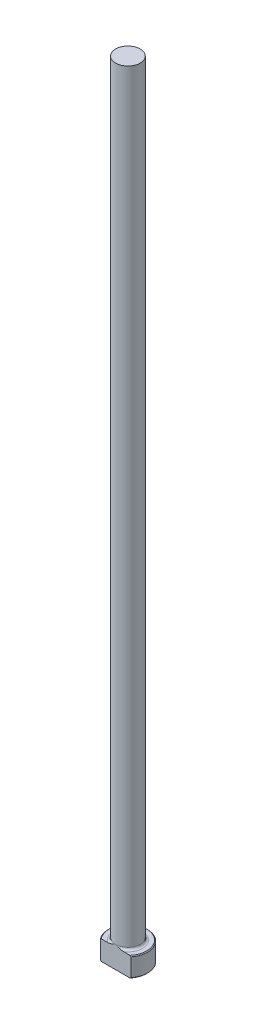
ISO-10303-21;
HEADER;
FILE_DESCRIPTION(('STEP AP214'),'2;1');
FILE_NAME('part.step','',(''),(''),'','','');
FILE_SCHEMA(('AUTOMOTIVE_DESIGN { 1 0 10303 214 1 1 1 1 }'));
ENDSEC;
DATA;
#1=APPLICATION_CONTEXT('core data for automotive mechanical design processes');
#2=APPLICATION_PROTOCOL_DEFINITION('international standard','automotive_design',2000,#1);
#3=PRODUCT_CONTEXT('',#1,'mechanical');
#4=PRODUCT('Part','Part','',(#3));
#5=PRODUCT_RELATED_PRODUCT_CATEGORY('part','',(#4));
#6=PRODUCT_DEFINITION_FORMATION('','',#4);
#7=PRODUCT_DEFINITION_CONTEXT('part definition',#1,'design');
#8=PRODUCT_DEFINITION('design','',#6,#7);
#9=PRODUCT_DEFINITION_SHAPE('','',#8);
#10=(LENGTH_UNIT() NAMED_UNIT(*) SI_UNIT(.MILLI.,.METRE.));
#11=(NAMED_UNIT(*) PLANE_ANGLE_UNIT() SI_UNIT($,.RADIAN.));
#12=(NAMED_UNIT(*) SI_UNIT($,.STERADIAN.) SOLID_ANGLE_UNIT());
#13=UNCERTAINTY_MEASURE_WITH_UNIT(LENGTH_MEASURE(1.E-05),#10,'distance_accuracy_value','');
#14=(GEOMETRIC_REPRESENTATION_CONTEXT(3) GLOBAL_UNCERTAINTY_ASSIGNED_CONTEXT((#13)) GLOBAL_UNIT_ASSIGNED_CONTEXT((#10,
#11,#12)) REPRESENTATION_CONTEXT('',''));
#15=CARTESIAN_POINT('',(0.,0.,0.));
#16=DIRECTION('',(0.,0.,1.));
#17=DIRECTION('',(1.,0.,0.));
#18=AXIS2_PLACEMENT_3D('',#15,#16,#17);
#19=CARTESIAN_POINT('',(0.,0.,0.));
#20=DIRECTION('',(0.,-1.,0.));
#21=DIRECTION('',(0.,0.,-1.));
#22=AXIS2_PLACEMENT_3D('',#19,#20,#21);
#23=PLANE('',#22);
#24=DIRECTION('',(1.,0.,0.));
#25=VECTOR('',#24,1.);
#26=CARTESIAN_POINT('',(-4.95696716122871,0.,3.96874999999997));
#27=LINE('',#26,#25);
#28=CARTESIAN_POINT('',(-4.62711999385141,0.,3.96874999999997));
#29=VERTEX_POINT('',#28);
#30=CARTESIAN_POINT('',(4.62711999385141,0.,3.96874999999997));
#31=VERTEX_POINT('',#30);
#32=EDGE_CURVE('E92',#29,#31,#27,.T.);
#33=ORIENTED_EDGE('',*,*,#32,.F.);
#34=CARTESIAN_POINT('',(0.,0.,0.));
#35=DIRECTION('',(0.,-1.,0.));
#36=DIRECTION('',(0.,0.,-1.));
#37=AXIS2_PLACEMENT_3D('',#34,#35,#36);
#38=CIRCLE('',#37,6.09599999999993);
#39=EDGE_CURVE('E105',#29,#31,#38,.T.);
#40=ORIENTED_EDGE('',*,*,#39,.T.);
#41=EDGE_LOOP('',(#33,#40));
#42=FACE_BOUND('',#41,.T.);
#43=ADVANCED_FACE('F37',(#42),#23,.T.);
#44=CARTESIAN_POINT('',(0.,259.958771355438,0.));
#45=DIRECTION('',(0.,1.,0.));
#46=DIRECTION('',(0.,0.,1.));
#47=AXIS2_PLACEMENT_3D('',#44,#45,#46);
#48=CYLINDRICAL_SURFACE('',#47,6.34999999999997);
#49=DIRECTION('',(0.,-1.,0.));
#50=VECTOR('',#49,1.);
#51=CARTESIAN_POINT('',(-4.95696716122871,254.,3.96874999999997));
#52=LINE('',#51,#50);
#53=CARTESIAN_POINT('',(-4.95696716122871,6.09600000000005,3.96874999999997));
#54=VERTEX_POINT('',#53);
#55=CARTESIAN_POINT('',(-4.95696716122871,0.254000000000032,3.96874999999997));
#56=VERTEX_POINT('',#55);
#57=EDGE_CURVE('E95',#54,#56,#52,.T.);
#58=ORIENTED_EDGE('',*,*,#57,.F.);
#59=CARTESIAN_POINT('',(0.,6.09600000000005,0.));
#60=DIRECTION('',(0.,1.,0.));
#61=DIRECTION('',(0.,0.,1.));
#62=AXIS2_PLACEMENT_3D('',#59,#60,#61);
#63=CIRCLE('',#62,6.34999999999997);
#64=CARTESIAN_POINT('',(4.95696716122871,6.09600000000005,3.96874999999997));
#65=VERTEX_POINT('',#64);
#66=EDGE_CURVE('E109',#54,#65,#63,.F.);
#67=ORIENTED_EDGE('',*,*,#66,.T.);
#68=DIRECTION('',(0.,-1.,0.));
#69=VECTOR('',#68,1.);
#70=CARTESIAN_POINT('',(4.95696716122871,254.,3.96874999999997));
#71=LINE('',#70,#69);
#72=CARTESIAN_POINT('',(4.95696716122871,0.254000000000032,3.96874999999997));
#73=VERTEX_POINT('',#72);
#74=EDGE_CURVE('E187',#65,#73,#71,.T.);
#75=ORIENTED_EDGE('',*,*,#74,.T.);
#76=CARTESIAN_POINT('',(0.,0.254000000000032,0.));
#77=DIRECTION('',(0.,-1.,0.));
#78=DIRECTION('',(0.,0.,-1.));
#79=AXIS2_PLACEMENT_3D('',#76,#77,#78);
#80=CIRCLE('',#79,6.34999999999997);
#81=EDGE_CURVE('E115',#73,#56,#80,.F.);
#82=ORIENTED_EDGE('',*,*,#81,.T.);
#83=EDGE_LOOP('',(#58,#67,#75,#82));
#84=FACE_BOUND('',#83,.T.);
#85=ADVANCED_FACE('F160',(#84),#48,.T.);
#86=CARTESIAN_POINT('',(-6.34999999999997,6.35,0.));
#87=DIRECTION('',(0.,1.,0.));
#88=DIRECTION('',(0.,0.,1.));
#89=AXIS2_PLACEMENT_3D('',#86,#87,#88);
#90=PLANE('',#89);
#91=DIRECTION('',(-1.,0.,0.));
#92=VECTOR('',#91,1.);
#93=CARTESIAN_POINT('',(-6.34999999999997,6.35,3.96874999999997));
#94=LINE('',#93,#92);
#95=CARTESIAN_POINT('',(4.62711999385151,6.35,3.96874999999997));
#96=VERTEX_POINT('',#95);
#97=CARTESIAN_POINT('',(2.57468813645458,6.35,3.96874999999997));
#98=VERTEX_POINT('',#97);
#99=EDGE_CURVE('E58',#96,#98,#94,.T.);
#100=ORIENTED_EDGE('',*,*,#99,.F.);
#101=CARTESIAN_POINT('',(0.,6.35,0.));
#102=DIRECTION('',(0.,1.,0.));
#103=DIRECTION('',(0.,0.,1.));
#104=AXIS2_PLACEMENT_3D('',#101,#102,#103);
#105=CIRCLE('',#104,6.09600000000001);
#106=CARTESIAN_POINT('',(-4.62711999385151,6.35,3.96874999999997));
#107=VERTEX_POINT('',#106);
#108=EDGE_CURVE('E182',#96,#107,#105,.T.);
#109=ORIENTED_EDGE('',*,*,#108,.T.);
#110=CARTESIAN_POINT('',(-2.57468813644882,6.35000000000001,3.96874999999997));
#111=VERTEX_POINT('',#110);
#112=EDGE_CURVE('E140',#111,#107,#94,.T.);
#113=ORIENTED_EDGE('',*,*,#112,.F.);
#114=CARTESIAN_POINT('',(0.,6.35,0.));
#115=DIRECTION('',(0.,1.,0.));
#116=DIRECTION('',(0.,0.,1.));
#117=AXIS2_PLACEMENT_3D('',#114,#115,#116);
#118=CIRCLE('',#117,4.73074999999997);
#119=EDGE_CURVE('E112',#111,#98,#118,.F.);
#120=ORIENTED_EDGE('',*,*,#119,.T.);
#121=EDGE_LOOP('',(#100,#109,#113,#120));
#122=FACE_BOUND('',#121,.T.);
#123=ADVANCED_FACE('F164',(#122),#90,.T.);
#124=CARTESIAN_POINT('',(0.,259.958771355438,0.));
#125=DIRECTION('',(0.,1.,0.));
#126=DIRECTION('',(0.,0.,1.));
#127=AXIS2_PLACEMENT_3D('',#124,#125,#126);
#128=CYLINDRICAL_SURFACE('',#127,3.96874999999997);
#129=CARTESIAN_POINT('',(0.,7.11200000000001,0.));
#130=DIRECTION('',(0.,1.,0.));
#131=DIRECTION('',(0.,0.,1.));
#132=AXIS2_PLACEMENT_3D('',#129,#130,#131);
#133=CIRCLE('',#132,3.96874999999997);
#134=CARTESIAN_POINT('',(0.,7.11200000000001,3.96874999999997));
#135=VERTEX_POINT('',#134);
#136=EDGE_CURVE('E108',#135,#135,#133,.T.);
#137=ORIENTED_EDGE('',*,*,#136,.T.);
#138=EDGE_LOOP('',(#137));
#139=FACE_BOUND('',#138,.T.);
#140=CARTESIAN_POINT('',(0.,254.,0.));
#141=DIRECTION('',(0.,1.,0.));
#142=DIRECTION('',(0.,0.,1.));
#143=AXIS2_PLACEMENT_3D('',#140,#141,#142);
#144=CIRCLE('',#143,3.96874999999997);
#145=CARTESIAN_POINT('',(0.,254.,3.96874999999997));
#146=VERTEX_POINT('',#145);
#147=EDGE_CURVE('E100',#146,#146,#144,.T.);
#148=ORIENTED_EDGE('',*,*,#147,.F.);
#149=EDGE_LOOP('',(#148));
#150=FACE_BOUND('',#149,.T.);
#151=ADVANCED_FACE('F169',(#139,#150),#128,.T.);
#152=CARTESIAN_POINT('',(-3.96874999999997,254.,0.));
#153=DIRECTION('',(0.,1.,0.));
#154=DIRECTION('',(0.,0.,1.));
#155=AXIS2_PLACEMENT_3D('',#152,#153,#154);
#156=PLANE('',#155);
#157=ORIENTED_EDGE('',*,*,#147,.T.);
#158=EDGE_LOOP('',(#157));
#159=FACE_BOUND('',#158,.T.);
#160=ADVANCED_FACE('F127',(#159),#156,.T.);
#161=CARTESIAN_POINT('',(0.,6.35000000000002,0.));
#162=DIRECTION('',(0.,-1.,0.));
#163=DIRECTION('',(0.,0.,-1.));
#164=AXIS2_PLACEMENT_3D('',#161,#162,#163);
#165=CONICAL_SURFACE('',#164,6.09599999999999,0.78539816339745);
#166=CARTESIAN_POINT('',(4.95766716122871,6.09545354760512,3.96874999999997));
#167=CARTESIAN_POINT('',(4.84362600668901,6.18446465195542,3.96874999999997));
#168=CARTESIAN_POINT('',(4.72901418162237,6.27275468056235,3.96874999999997));
#169=CARTESIAN_POINT('',(4.49842455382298,6.44757608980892,3.96874999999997));
#170=CARTESIAN_POINT('',(4.38244649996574,6.5341071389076,3.96874999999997));
#171=CARTESIAN_POINT('',(4.14825741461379,6.70556195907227,3.96874999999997));
#172=CARTESIAN_POINT('',(4.03003727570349,6.79047332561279,3.96874999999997));
#173=CARTESIAN_POINT('',(3.79178298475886,6.9577042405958,3.96874999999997));
#174=CARTESIAN_POINT('',(3.67174893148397,7.04002392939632,3.96874999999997));
#175=CARTESIAN_POINT('',(3.42311396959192,7.2058048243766,3.96874999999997));
#176=CARTESIAN_POINT('',(3.29439734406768,7.28909320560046,3.96874999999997));
#177=CARTESIAN_POINT('',(3.03423258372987,7.4512831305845,3.96874999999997));
#178=CARTESIAN_POINT('',(2.90278471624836,7.53018510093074,3.96874999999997));
#179=CARTESIAN_POINT('',(2.63699939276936,7.68229455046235,3.96874999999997));
#180=CARTESIAN_POINT('',(2.50266895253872,7.75551421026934,3.96874999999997));
#181=CARTESIAN_POINT('',(2.23043438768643,7.89493973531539,3.96874999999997));
#182=CARTESIAN_POINT('',(2.09253143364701,7.9611478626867,3.96874999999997));
#183=CARTESIAN_POINT('',(1.82827645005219,8.07780495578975,3.96874999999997));
#184=CARTESIAN_POINT('',(1.70233977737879,8.12918734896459,3.96874999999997));
#185=CARTESIAN_POINT('',(1.44721315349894,8.22328163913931,3.96874999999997));
#186=CARTESIAN_POINT('',(1.31802288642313,8.2659926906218,3.96874999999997));
#187=CARTESIAN_POINT('',(1.05825390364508,8.34044186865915,3.96874999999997));
#188=CARTESIAN_POINT('',(0.927713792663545,8.3723127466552,3.96874999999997));
#189=CARTESIAN_POINT('',(0.664295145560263,8.42410829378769,3.96874999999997));
#190=CARTESIAN_POINT('',(0.53141752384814,8.44403753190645,3.96874999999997));
#191=CARTESIAN_POINT('',(0.262097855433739,8.4708973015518,3.96874999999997));
#192=CARTESIAN_POINT('',(0.125633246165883,8.477606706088,3.96874999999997));
#193=CARTESIAN_POINT('',(-0.14725268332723,8.47686385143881,3.96874999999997));
#194=CARTESIAN_POINT('',(-0.283674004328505,8.4694118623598,3.96874999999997));
#195=CARTESIAN_POINT('',(-0.555656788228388,8.44083507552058,3.96874999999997));
#196=CARTESIAN_POINT('',(-0.691211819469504,8.41965021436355,3.96874999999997));
#197=CARTESIAN_POINT('',(-0.959794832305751,8.36496246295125,3.96874999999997));
#198=CARTESIAN_POINT('',(-1.09282217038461,8.33145647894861,3.96874999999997));
#199=CARTESIAN_POINT('',(-1.4083928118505,8.23843789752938,3.96874999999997));
#200=CARTESIAN_POINT('',(-1.58944011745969,8.17388386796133,3.96874999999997));
#201=CARTESIAN_POINT('',(-1.94516794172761,8.02919443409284,3.96874999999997));
#202=CARTESIAN_POINT('',(-2.11984380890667,7.94904790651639,3.96874999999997));
#203=CARTESIAN_POINT('',(-2.464343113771,7.77678193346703,3.96874999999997));
#204=CARTESIAN_POINT('',(-2.63413363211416,7.68459751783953,3.96874999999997));
#205=CARTESIAN_POINT('',(-2.96866520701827,7.49168011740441,3.96874999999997));
#206=CARTESIAN_POINT('',(-3.13340772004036,7.39094963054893,3.96874999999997));
#207=CARTESIAN_POINT('',(-3.4408871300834,7.19449593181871,3.96874999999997));
#208=CARTESIAN_POINT('',(-3.58405296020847,7.09943870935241,3.96874999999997));
#209=CARTESIAN_POINT('',(-3.86765398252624,6.90532828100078,3.96874999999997));
#210=CARTESIAN_POINT('',(-4.00808899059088,6.80627480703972,3.96874999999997));
#211=CARTESIAN_POINT('',(-4.2844427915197,6.60661425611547,3.96874999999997));
#212=CARTESIAN_POINT('',(-4.42039789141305,6.50605721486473,3.96874999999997));
#213=CARTESIAN_POINT('',(-4.6903816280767,6.30247434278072,3.96874999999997));
#214=CARTESIAN_POINT('',(-4.82441086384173,6.19944930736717,3.96874999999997));
#215=CARTESIAN_POINT('',(-4.95766716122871,6.09545354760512,3.96874999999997));
#216=B_SPLINE_CURVE_WITH_KNOTS('',3,(#166,#167,#168,#169,#170,#171,#172,#173,#174,#175,#176,
#177,#178,#179,#180,#181,#182,#183,#184,#185,#186,#187,#188,#189,#190,#191,#192,#193,#194,#195,
#196,#197,#198,#199,#200,#201,#202,#203,#204,#205,#206,#207,#208,#209,#210,#211,#212,#213,#214,
#215),.UNSPECIFIED.,.F.,.F.,(4,2,2,2,2,2,2,2,2,2,2,2,2,2,2,2,2,2,2,2,2,2,2,2,4),(0.,
0.43400543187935,0.868091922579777,1.3047245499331,1.74133348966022,2.20120262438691,
2.66102695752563,3.11983669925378,3.57849796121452,3.98628616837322,4.39411411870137,
4.7967509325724,5.19923359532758,5.60839324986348,6.01754510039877,6.4284986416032,
6.83955544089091,7.4151649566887,7.99118661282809,8.57045663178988,9.14955791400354,
9.66502728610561,10.1805312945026,10.6878068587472,11.1949210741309),.UNSPECIFIED.);
#217=EDGE_CURVE('E63',#65,#96,#216,.T.);
#218=ORIENTED_EDGE('',*,*,#217,.F.);
#219=ORIENTED_EDGE('',*,*,#66,.F.);
#220=EDGE_CURVE('E133',#107,#54,#216,.T.);
#221=ORIENTED_EDGE('',*,*,#220,.F.);
#222=ORIENTED_EDGE('',*,*,#108,.F.);
#223=EDGE_LOOP('',(#218,#219,#221,#222));
#224=FACE_BOUND('',#223,.T.);
#225=ADVANCED_FACE('F147',(#224),#165,.T.);
#226=CARTESIAN_POINT('',(0.,0.254000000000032,0.));
#227=DIRECTION('',(0.,1.,0.));
#228=DIRECTION('',(0.,0.,1.));
#229=AXIS2_PLACEMENT_3D('',#226,#227,#228);
#230=CONICAL_SURFACE('',#229,6.34999999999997,0.78539816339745);
#231=CARTESIAN_POINT('',(-4.95766716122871,0.254546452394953,3.96874999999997));
#232=CARTESIAN_POINT('',(-4.84362600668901,0.165535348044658,3.96874999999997));
#233=CARTESIAN_POINT('',(-4.72901418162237,0.077245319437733,3.96874999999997));
#234=CARTESIAN_POINT('',(-4.49842455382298,-0.0975760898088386,3.96874999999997));
#235=CARTESIAN_POINT('',(-4.38244649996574,-0.184107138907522,3.96874999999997));
#236=CARTESIAN_POINT('',(-4.14825741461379,-0.355561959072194,3.96874999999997));
#237=CARTESIAN_POINT('',(-4.03003727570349,-0.440473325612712,3.96874999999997));
#238=CARTESIAN_POINT('',(-3.79178298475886,-0.607704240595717,3.96874999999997));
#239=CARTESIAN_POINT('',(-3.67174893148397,-0.690023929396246,3.96874999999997));
#240=CARTESIAN_POINT('',(-3.42311396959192,-0.855804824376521,3.96874999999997));
#241=CARTESIAN_POINT('',(-3.29439734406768,-0.939093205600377,3.96874999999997));
#242=CARTESIAN_POINT('',(-3.03423258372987,-1.10128313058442,3.96874999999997));
#243=CARTESIAN_POINT('',(-2.90278471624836,-1.18018510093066,3.96874999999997));
#244=CARTESIAN_POINT('',(-2.63699939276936,-1.33229455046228,3.96874999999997));
#245=CARTESIAN_POINT('',(-2.50266895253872,-1.40551421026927,3.96874999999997));
#246=CARTESIAN_POINT('',(-2.23043438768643,-1.54493973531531,3.96874999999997));
#247=CARTESIAN_POINT('',(-2.09253143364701,-1.61114786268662,3.96874999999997));
#248=CARTESIAN_POINT('',(-1.82827645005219,-1.72780495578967,3.96874999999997));
#249=CARTESIAN_POINT('',(-1.70233977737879,-1.77918734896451,3.96874999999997));
#250=CARTESIAN_POINT('',(-1.44721315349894,-1.87328163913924,3.96874999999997));
#251=CARTESIAN_POINT('',(-1.31802288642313,-1.91599269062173,3.96874999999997));
#252=CARTESIAN_POINT('',(-1.05825390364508,-1.99044186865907,3.96874999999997));
#253=CARTESIAN_POINT('',(-0.927713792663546,-2.02231274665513,3.96874999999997));
#254=CARTESIAN_POINT('',(-0.664295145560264,-2.07410829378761,3.96874999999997));
#255=CARTESIAN_POINT('',(-0.531417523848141,-2.09403753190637,3.96874999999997));
#256=CARTESIAN_POINT('',(-0.262097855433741,-2.12089730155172,3.96874999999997));
#257=CARTESIAN_POINT('',(-0.125633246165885,-2.12760670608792,3.96874999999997));
#258=CARTESIAN_POINT('',(0.147252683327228,-2.12686385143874,3.96874999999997));
#259=CARTESIAN_POINT('',(0.283674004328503,-2.11941186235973,3.96874999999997));
#260=CARTESIAN_POINT('',(0.555656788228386,-2.0908350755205,3.96874999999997));
#261=CARTESIAN_POINT('',(0.691211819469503,-2.06965021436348,3.96874999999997));
#262=CARTESIAN_POINT('',(0.959794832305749,-2.01496246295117,3.96874999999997));
#263=CARTESIAN_POINT('',(1.0928221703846,-1.98145647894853,3.96874999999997));
#264=CARTESIAN_POINT('',(1.4083928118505,-1.8884378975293,3.96874999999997));
#265=CARTESIAN_POINT('',(1.58944011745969,-1.82388386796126,3.96874999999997));
#266=CARTESIAN_POINT('',(1.9451679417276,-1.67919443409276,3.96874999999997));
#267=CARTESIAN_POINT('',(2.11984380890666,-1.59904790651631,3.96874999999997));
#268=CARTESIAN_POINT('',(2.46434311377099,-1.42678193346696,3.96874999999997));
#269=CARTESIAN_POINT('',(2.63413363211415,-1.33459751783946,3.96874999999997));
#270=CARTESIAN_POINT('',(2.96866520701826,-1.14168011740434,3.96874999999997));
#271=CARTESIAN_POINT('',(3.13340772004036,-1.04094963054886,3.96874999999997));
#272=CARTESIAN_POINT('',(3.4408871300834,-0.844495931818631,3.96874999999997));
#273=CARTESIAN_POINT('',(3.58405296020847,-0.749438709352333,3.96874999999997));
#274=CARTESIAN_POINT('',(3.86765398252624,-0.555328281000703,3.96874999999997));
#275=CARTESIAN_POINT('',(4.00808899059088,-0.456274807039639,3.96874999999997));
#276=CARTESIAN_POINT('',(4.2844427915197,-0.256614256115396,3.96874999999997));
#277=CARTESIAN_POINT('',(4.42039789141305,-0.156057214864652,3.96874999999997));
#278=CARTESIAN_POINT('',(4.6903816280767,0.0475256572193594,3.96874999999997));
#279=CARTESIAN_POINT('',(4.82441086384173,0.150550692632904,3.96874999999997));
#280=CARTESIAN_POINT('',(4.95766716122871,0.254546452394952,3.96874999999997));
#281=B_SPLINE_CURVE_WITH_KNOTS('',3,(#231,#232,#233,#234,#235,#236,#237,#238,#239,#240,#241,
#242,#243,#244,#245,#246,#247,#248,#249,#250,#251,#252,#253,#254,#255,#256,#257,#258,#259,#260,
#261,#262,#263,#264,#265,#266,#267,#268,#269,#270,#271,#272,#273,#274,#275,#276,#277,#278,#279,
#280),.UNSPECIFIED.,.F.,.F.,(4,2,2,2,2,2,2,2,2,2,2,2,2,2,2,2,2,2,2,2,2,2,2,2,4),(0.,
0.434005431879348,0.868091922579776,1.3047245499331,1.74133348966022,2.20120262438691,
2.66102695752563,3.11983669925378,3.57849796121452,3.98628616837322,4.39411411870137,
4.7967509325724,5.19923359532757,5.60839324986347,6.01754510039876,6.4284986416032,
6.83955544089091,7.4151649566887,7.99118661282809,8.57045663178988,9.14955791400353,
9.66502728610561,10.1805312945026,10.6878068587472,11.1949210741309),.UNSPECIFIED.);
#282=EDGE_CURVE('E89',#56,#29,#281,.T.);
#283=ORIENTED_EDGE('',*,*,#282,.F.);
#284=ORIENTED_EDGE('',*,*,#81,.F.);
#285=EDGE_CURVE('E101',#31,#73,#281,.T.);
#286=ORIENTED_EDGE('',*,*,#285,.F.);
#287=ORIENTED_EDGE('',*,*,#39,.F.);
#288=EDGE_LOOP('',(#283,#284,#286,#287));
#289=FACE_BOUND('',#288,.T.);
#290=ADVANCED_FACE('F107',(#289),#230,.T.);
#291=CARTESIAN_POINT('',(0.,7.11200000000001,0.));
#292=DIRECTION('',(0.,1.,0.));
#293=DIRECTION('',(0.,0.,1.));
#294=AXIS2_PLACEMENT_3D('',#291,#292,#293);
#295=TOROIDAL_SURFACE('',#294,4.73074999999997,0.762);
#296=ORIENTED_EDGE('',*,*,#119,.F.);
#297=CARTESIAN_POINT('',(0.,7.11200000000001,3.96874999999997));
#298=CARTESIAN_POINT('',(-2.72452874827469E-10,7.11200100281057,3.96874999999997));
#299=CARTESIAN_POINT('',(-1.89097572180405E-07,7.11200200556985,3.96874999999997));
#300=CARTESIAN_POINT('',(-7.99901127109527E-07,7.11200394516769,3.96874999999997));
#301=CARTESIAN_POINT('',(-1.2266662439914E-06,7.11200488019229,3.96874999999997));
#302=CARTESIAN_POINT('',(-2.25601477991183E-06,7.11200673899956,3.96874999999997));
#303=CARTESIAN_POINT('',(-2.86938873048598E-06,7.11200765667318,3.96874999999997));
#304=CARTESIAN_POINT('',(-4.2009410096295E-06,7.11200939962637,3.96874999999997));
#305=CARTESIAN_POINT('',(-4.91843246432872E-06,7.11201022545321,3.96874999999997));
#306=CARTESIAN_POINT('',(-7.4625804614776E-06,7.11201295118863,3.96874999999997));
#307=CARTESIAN_POINT('',(-9.42693843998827E-06,7.11201472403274,3.96874999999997));
#308=CARTESIAN_POINT('',(-1.35156238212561E-05,7.11201792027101,3.96874999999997));
#309=CARTESIAN_POINT('',(-1.56334419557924E-05,7.11201935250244,3.96874999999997));
#310=CARTESIAN_POINT('',(-2.37794366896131E-05,7.11202462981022,3.96874999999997));
#311=CARTESIAN_POINT('',(-3.00000425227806E-05,7.11202818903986,3.96874999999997));
#312=CARTESIAN_POINT('',(-4.23604379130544E-05,7.11203410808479,3.96874999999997));
#313=CARTESIAN_POINT('',(-4.84662901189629E-05,7.11203654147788,3.96874999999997));
#314=CARTESIAN_POINT('',(-7.41361994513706E-05,7.11204669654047,3.96874999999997));
#315=CARTESIAN_POINT('',(-9.37464432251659E-05,7.11205427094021,3.96874999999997));
#316=CARTESIAN_POINT('',(-0.000130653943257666,7.11206661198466,3.96874999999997));
#317=CARTESIAN_POINT('',(-0.00014786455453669,7.11207162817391,3.96874999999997));
#318=CARTESIAN_POINT('',(-0.000271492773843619,7.11211085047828,3.96874999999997));
#319=CARTESIAN_POINT('',(-0.000372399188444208,7.11216017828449,3.96874999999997));
#320=CARTESIAN_POINT('',(-0.000762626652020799,7.11234384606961,3.96874999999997));
#321=CARTESIAN_POINT('',(-0.00105578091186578,7.1124669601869,3.96874999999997));
#322=CARTESIAN_POINT('',(-0.00218658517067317,7.11294905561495,3.96874999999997));
#323=CARTESIAN_POINT('',(-0.00302029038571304,7.11331980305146,3.96874999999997));
#324=CARTESIAN_POINT('',(-0.00641326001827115,7.11482126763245,3.96874999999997));
#325=CARTESIAN_POINT('',(-0.00897690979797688,7.1159386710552,3.96874999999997));
#326=CARTESIAN_POINT('',(-0.0431521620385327,7.13084393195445,3.96874999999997));
#327=CARTESIAN_POINT('',(-0.0747329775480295,7.14472589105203,3.96874999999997));
#328=CARTESIAN_POINT('',(-0.138371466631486,7.17259981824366,3.96874999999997));
#329=CARTESIAN_POINT('',(-0.170429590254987,7.18659058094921,3.96874999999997));
#330=CARTESIAN_POINT('',(-0.263897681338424,7.22728018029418,3.96874999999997));
#331=CARTESIAN_POINT('',(-0.32534291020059,7.25390148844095,3.96874999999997));
#332=CARTESIAN_POINT('',(-0.45545149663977,7.30966012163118,3.96874999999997));
#333=CARTESIAN_POINT('',(-0.524140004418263,7.33873873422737,3.96874999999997));
#334=CARTESIAN_POINT('',(-0.662588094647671,7.39626071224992,3.96874999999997));
#335=CARTESIAN_POINT('',(-0.732351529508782,7.42469485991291,3.96874999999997));
#336=CARTESIAN_POINT('',(-0.854677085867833,7.47322946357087,3.96874999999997));
#337=CARTESIAN_POINT('',(-0.907124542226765,7.49361793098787,3.96874999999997));
#338=CARTESIAN_POINT('',(-1.01222990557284,7.53345950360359,3.96874999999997));
#339=CARTESIAN_POINT('',(-1.06488701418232,7.55291472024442,3.96874999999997));
#340=CARTESIAN_POINT('',(-1.22118224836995,7.60890100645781,3.96874999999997));
#341=CARTESIAN_POINT('',(-1.32536392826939,7.64394780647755,3.96874999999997));
#342=CARTESIAN_POINT('',(-1.51475689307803,7.70222633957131,3.96874999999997));
#343=CARTESIAN_POINT('',(-1.59966831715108,7.72642606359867,3.96874999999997));
#344=CARTESIAN_POINT('',(-1.77115576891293,7.77055798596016,3.96874999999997));
#345=CARTESIAN_POINT('',(-1.85773874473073,7.79046358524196,3.96874999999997));
#346=CARTESIAN_POINT('',(-2.03663433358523,7.8256694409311,3.96874999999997));
#347=CARTESIAN_POINT('',(-2.12900742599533,7.84066973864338,3.96874999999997));
#348=CARTESIAN_POINT('',(-2.31450882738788,7.86300878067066,3.96874999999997));
#349=CARTESIAN_POINT('',(-2.40763490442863,7.87036510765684,3.96874999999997));
#350=CARTESIAN_POINT('',(-2.58622461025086,7.87533872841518,3.96874999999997));
#351=CARTESIAN_POINT('',(-2.67166229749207,7.87373524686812,3.96874999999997));
#352=CARTESIAN_POINT('',(-2.84116133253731,7.86073590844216,3.96874999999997));
#353=CARTESIAN_POINT('',(-2.92522821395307,7.84942227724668,3.96874999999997));
#354=CARTESIAN_POINT('',(-3.09260159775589,7.81445437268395,3.96874999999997));
#355=CARTESIAN_POINT('',(-3.17586039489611,7.79056108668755,3.96874999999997));
#356=CARTESIAN_POINT('',(-3.33637449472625,7.72711703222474,3.96874999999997));
#357=CARTESIAN_POINT('',(-3.41365062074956,7.6876237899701,3.96874999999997));
#358=CARTESIAN_POINT('',(-3.51798857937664,7.61566535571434,3.96874999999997));
#359=CARTESIAN_POINT('',(-3.55006318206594,7.59045187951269,3.96874999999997));
#360=CARTESIAN_POINT('',(-3.6102188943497,7.53557765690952,3.96874999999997));
#361=CARTESIAN_POINT('',(-3.63830099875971,7.50591802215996,3.96874999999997));
#362=CARTESIAN_POINT('',(-3.68933162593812,7.44181271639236,3.96874999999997));
#363=CARTESIAN_POINT('',(-3.7122145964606,7.40731395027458,3.96874999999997));
#364=CARTESIAN_POINT('',(-3.75063172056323,7.3344255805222,3.96874999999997));
#365=CARTESIAN_POINT('',(-3.76617854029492,7.29604282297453,3.96874999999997));
#366=CARTESIAN_POINT('',(-3.7867432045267,7.22260269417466,3.96874999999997));
#367=CARTESIAN_POINT('',(-3.79297266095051,7.18788564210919,3.96874999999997));
#368=CARTESIAN_POINT('',(-3.79840708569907,7.11791009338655,3.96874999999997));
#369=CARTESIAN_POINT('',(-3.79761729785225,7.08265202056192,3.96874999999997));
#370=CARTESIAN_POINT('',(-3.7897274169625,7.01808169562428,3.96874999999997));
#371=CARTESIAN_POINT('',(-3.78356056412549,6.98864967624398,3.96874999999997));
#372=CARTESIAN_POINT('',(-3.76657344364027,6.93117296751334,3.96874999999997));
#373=CARTESIAN_POINT('',(-3.75575305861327,6.90312831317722,3.96874999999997));
#374=CARTESIAN_POINT('',(-3.72949416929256,6.84779976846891,3.96874999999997));
#375=CARTESIAN_POINT('',(-3.713874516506,6.82060268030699,3.96874999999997));
#376=CARTESIAN_POINT('',(-3.67898159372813,6.76868386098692,3.96874999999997));
#377=CARTESIAN_POINT('',(-3.6597066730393,6.74396325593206,3.96874999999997));
#378=CARTESIAN_POINT('',(-3.60698815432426,6.68446341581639,3.96874999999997));
#379=CARTESIAN_POINT('',(-3.57151931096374,6.65147423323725,3.96874999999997));
#380=CARTESIAN_POINT('',(-3.49575447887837,6.59155388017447,3.96874999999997));
#381=CARTESIAN_POINT('',(-3.45544429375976,6.56464122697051,3.96874999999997));
#382=CARTESIAN_POINT('',(-3.35110964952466,6.50463027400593,3.96874999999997));
#383=CARTESIAN_POINT('',(-3.2851315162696,6.47494717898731,3.96874999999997));
#384=CARTESIAN_POINT('',(-3.1496628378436,6.42615277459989,3.96874999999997));
#385=CARTESIAN_POINT('',(-3.08017671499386,6.40702850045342,3.96874999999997));
#386=CARTESIAN_POINT('',(-2.95179922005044,6.38006601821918,3.96874999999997));
#387=CARTESIAN_POINT('',(-2.89318763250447,6.37083647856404,3.96874999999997));
#388=CARTESIAN_POINT('',(-2.77536712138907,6.35745547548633,3.96874999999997));
#389=CARTESIAN_POINT('',(-2.71615776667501,6.35330798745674,3.96874999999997));
#390=CARTESIAN_POINT('',(-2.53632384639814,6.34734840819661,3.96874999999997));
#391=CARTESIAN_POINT('',(-2.41545754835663,6.35237783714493,3.96874999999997));
#392=CARTESIAN_POINT('',(-2.21811250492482,6.3716785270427,3.96874999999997));
#393=CARTESIAN_POINT('',(-2.14116511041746,6.38201761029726,3.96874999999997));
#394=CARTESIAN_POINT('',(-1.98802972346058,6.40734893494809,3.96874999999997));
#395=CARTESIAN_POINT('',(-1.9118417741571,6.42234143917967,3.96874999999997));
#396=CARTESIAN_POINT('',(-1.6839709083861,6.47322550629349,3.96874999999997));
#397=CARTESIAN_POINT('',(-1.53360062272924,6.5149500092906,3.96874999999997));
#398=CARTESIAN_POINT('',(-1.24863432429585,6.60495823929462,3.96874999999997));
#399=CARTESIAN_POINT('',(-1.11376371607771,6.65241192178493,3.96874999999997));
#400=CARTESIAN_POINT('',(-0.847576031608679,6.75264930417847,3.96874999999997));
#401=CARTESIAN_POINT('',(-0.716236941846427,6.80537521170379,3.96874999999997));
#402=CARTESIAN_POINT('',(-0.544659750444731,6.87676192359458,3.96874999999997));
#403=CARTESIAN_POINT('',(-0.503794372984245,6.89395286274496,3.96874999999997));
#404=CARTESIAN_POINT('',(-0.421123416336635,6.92903262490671,3.96874999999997));
#405=CARTESIAN_POINT('',(-0.37932061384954,6.94692803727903,3.96874999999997));
#406=CARTESIAN_POINT('',(-0.308934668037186,6.97725002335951,3.96874999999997));
#407=CARTESIAN_POINT('',(-0.280329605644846,6.98962609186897,3.96874999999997));
#408=CARTESIAN_POINT('',(-0.223423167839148,7.0143301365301,3.96874999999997));
#409=CARTESIAN_POINT('',(-0.195121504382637,7.02665744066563,3.96874999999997));
#410=CARTESIAN_POINT('',(-0.141398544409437,7.05009288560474,3.96874999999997));
#411=CARTESIAN_POINT('',(-0.115975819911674,7.06119805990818,3.96874999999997));
#412=CARTESIAN_POINT('',(-0.0642235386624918,7.08387460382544,3.96874999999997));
#413=CARTESIAN_POINT('',(-0.0378947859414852,7.09544818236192,3.96874999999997));
#414=CARTESIAN_POINT('',(-0.00898087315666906,7.1080596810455,3.96874999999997));
#415=CARTESIAN_POINT('',(-0.00642114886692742,7.1091753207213,3.96874999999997));
#416=CARTESIAN_POINT('',(-0.00302915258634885,7.11067631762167,3.96874999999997));
#417=CARTESIAN_POINT('',(-0.00219250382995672,7.11104837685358,3.96874999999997));
#418=CARTESIAN_POINT('',(-0.0010579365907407,7.11153207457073,3.96874999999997));
#419=CARTESIAN_POINT('',(-0.000763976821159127,7.11165552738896,3.96874999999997));
#420=CARTESIAN_POINT('',(-0.000372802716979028,7.11183964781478,3.96874999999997));
#421=CARTESIAN_POINT('',(-0.000271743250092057,7.111889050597,3.96874999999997));
#422=CARTESIAN_POINT('',(-0.000147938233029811,7.11192831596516,3.96874999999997));
#423=CARTESIAN_POINT('',(-0.000130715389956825,7.11193333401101,3.96874999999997));
#424=CARTESIAN_POINT('',(-9.3781335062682E-05,7.11194568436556,3.96874999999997));
#425=CARTESIAN_POINT('',(-7.41570977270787E-05,7.11195326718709,3.96874999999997));
#426=CARTESIAN_POINT('',(-4.84714569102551E-05,7.11196343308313,3.96874999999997));
#427=CARTESIAN_POINT('',(-4.23636191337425E-05,7.11196586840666,3.96874999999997));
#428=CARTESIAN_POINT('',(-2.99995408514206E-05,7.11197179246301,3.96874999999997));
#429=CARTESIAN_POINT('',(-2.37773032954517E-05,7.11197535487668,3.96874999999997));
#430=CARTESIAN_POINT('',(-1.5629804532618E-05,7.11198063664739,3.96874999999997));
#431=CARTESIAN_POINT('',(-1.3511828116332E-05,7.11198206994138,3.96874999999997));
#432=CARTESIAN_POINT('',(-9.42304071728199E-06,7.11198526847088,3.96874999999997));
#433=CARTESIAN_POINT('',(-7.45874783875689E-06,7.11198704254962,3.96874999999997));
#434=CARTESIAN_POINT('',(-4.91494695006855E-06,7.11198977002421,3.96874999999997));
#435=CARTESIAN_POINT('',(-4.19760643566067E-06,7.11199059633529,3.96874999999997));
#436=CARTESIAN_POINT('',(-2.86644232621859E-06,7.11199234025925,3.96874999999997));
#437=CARTESIAN_POINT('',(-2.25330635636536E-06,7.11199325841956,3.96874999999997));
#438=CARTESIAN_POINT('',(-1.22453499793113E-06,7.11199511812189,3.96874999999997));
#439=CARTESIAN_POINT('',(-7.98099013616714E-07,7.11199605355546,3.96874999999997));
#440=CARTESIAN_POINT('',(-1.88090826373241E-07,7.11199799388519,3.96874999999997));
#441=CARTESIAN_POINT('',(2.72512968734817E-10,7.11199899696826,3.96874999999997));
#442=CARTESIAN_POINT('',(0.,7.11200000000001,3.96874999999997));
#443=B_SPLINE_CURVE_WITH_KNOTS('',3,(#297,#298,#299,#300,#301,#302,#303,#304,#305,#306,#307,
#308,#309,#310,#311,#312,#313,#314,#315,#316,#317,#318,#319,#320,#321,#322,#323,#324,#325,#326,
#327,#328,#329,#330,#331,#332,#333,#334,#335,#336,#337,#338,#339,#340,#341,#342,#343,#344,#345,
#346,#347,#348,#349,#350,#351,#352,#353,#354,#355,#356,#357,#358,#359,#360,#361,#362,#363,#364,
#365,#366,#367,#368,#369,#370,#371,#372,#373,#374,#375,#376,#377,#378,#379,#380,#381,#382,#383,
#384,#385,#386,#387,#388,#389,#390,#391,#392,#393,#394,#395,#396,#397,#398,#399,#400,#401,#402,
#403,#404,#405,#406,#407,#408,#409,#410,#411,#412,#413,#414,#415,#416,#417,#418,#419,#420,#421,
#422,#423,#424,#425,#426,#427,#428,#429,#430,#431,#432,#433,#434,#435,#436,#437,#438,#439,#440,
#441,#442),.UNSPECIFIED.,.T.,.F.,(4,2,2,2,2,2,2,2,2,2,2,2,2,2,2,2,2,2,2,2,2,2,2,2,2,2,2,2,2,2,2,
2,2,2,2,2,2,2,2,2,2,2,2,2,2,2,2,2,2,2,2,2,2,2,2,2,2,2,2,2,2,2,2,2,2,2,2,2,2,2,2,2,4),(0.,
3.0057780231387E-06,6.07432687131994E-06,9.37314624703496E-06,1.26511167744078E-05,
2.05502244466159E-05,2.82140028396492E-05,4.9640489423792E-05,6.93390753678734E-05,
0.000132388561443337,0.000186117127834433,0.0005216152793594,0.00147666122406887,
0.00421247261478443,0.0126037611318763,0.116083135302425,0.2210203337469,0.42190992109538,
0.645676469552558,0.871672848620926,1.04047829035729,1.20888182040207,1.53851282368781,
1.80329858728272,2.06968019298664,2.3501784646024,2.63003009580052,2.88594405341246,
3.13971207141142,3.39848556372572,3.65631358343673,3.77836256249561,3.90038107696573,
4.02386182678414,4.14712859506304,4.25227920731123,4.35735127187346,4.44716152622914,
4.53697404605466,4.63071137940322,4.72449114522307,4.86898620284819,5.01391581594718,
5.22974914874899,5.44531687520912,5.62306851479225,5.8009591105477,6.16266479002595,
6.3954713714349,6.62829110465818,7.09579230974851,7.52455372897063,7.94904482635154,
8.08204777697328,8.21846301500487,8.31196587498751,8.40457450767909,8.4878041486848,
8.57407464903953,8.58245304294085,8.58519851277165,8.58615618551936,8.58649219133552,
8.5865459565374,8.58660905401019,8.5866287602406,8.58665019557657,8.58665786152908,
8.58666576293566,8.58666904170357,8.58667234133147,8.58667541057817,8.58667841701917),.UNSPECIFIED.);
#444=EDGE_CURVE('E11',#111,#135,#443,.T.);
#445=ORIENTED_EDGE('',*,*,#444,.T.);
#446=ORIENTED_EDGE('',*,*,#136,.F.);
#447=CARTESIAN_POINT('',(0.,7.11200000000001,3.96874999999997));
#448=CARTESIAN_POINT('',(2.72452813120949E-10,7.11199899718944,3.96874999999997));
#449=CARTESIAN_POINT('',(1.89097572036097E-07,7.11199799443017,3.96874999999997));
#450=CARTESIAN_POINT('',(7.99901127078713E-07,7.11199605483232,3.96874999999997));
#451=CARTESIAN_POINT('',(1.22666624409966E-06,7.11199511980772,3.96874999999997));
#452=CARTESIAN_POINT('',(2.25601477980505E-06,7.11199326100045,3.96874999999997));
#453=CARTESIAN_POINT('',(2.86938873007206E-06,7.11199234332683,3.96874999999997));
#454=CARTESIAN_POINT('',(4.20094100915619E-06,7.11199060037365,3.96874999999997));
#455=CARTESIAN_POINT('',(4.91843246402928E-06,7.1119897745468,3.96874999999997));
#456=CARTESIAN_POINT('',(7.46258046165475E-06,7.11198704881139,3.96874999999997));
#457=CARTESIAN_POINT('',(9.42693844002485E-06,7.11198527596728,3.96874999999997));
#458=CARTESIAN_POINT('',(1.35156238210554E-05,7.11198207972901,3.96874999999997));
#459=CARTESIAN_POINT('',(1.56334419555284E-05,7.11198064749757,3.96874999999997));
#460=CARTESIAN_POINT('',(2.3779436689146E-05,7.11197537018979,3.96874999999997));
#461=CARTESIAN_POINT('',(3.00000425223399E-05,7.11197181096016,3.96874999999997));
#462=CARTESIAN_POINT('',(4.23604379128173E-05,7.11196589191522,3.96874999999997));
#463=CARTESIAN_POINT('',(4.84662901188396E-05,7.11196345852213,3.96874999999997));
#464=CARTESIAN_POINT('',(7.41361994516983E-05,7.11195330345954,3.96874999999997));
#465=CARTESIAN_POINT('',(9.37464432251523E-05,7.11194572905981,3.96874999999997));
#466=CARTESIAN_POINT('',(0.000130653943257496,7.11193338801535,3.96874999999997));
#467=CARTESIAN_POINT('',(0.000147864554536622,7.1119283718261,3.96874999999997));
#468=CARTESIAN_POINT('',(0.00027149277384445,7.11188914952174,3.96874999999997));
#469=CARTESIAN_POINT('',(0.000372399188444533,7.11183982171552,3.96874999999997));
#470=CARTESIAN_POINT('',(0.000762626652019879,7.1116561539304,3.96874999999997));
#471=CARTESIAN_POINT('',(0.00105578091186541,7.11153303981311,3.96874999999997));
#472=CARTESIAN_POINT('',(0.00218658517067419,7.11105094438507,3.96874999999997));
#473=CARTESIAN_POINT('',(0.00302029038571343,7.11068019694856,3.96874999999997));
#474=CARTESIAN_POINT('',(0.00641326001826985,7.10917873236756,3.96874999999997));
#475=CARTESIAN_POINT('',(0.00897690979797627,7.10806132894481,3.96874999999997));
#476=CARTESIAN_POINT('',(0.0431521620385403,7.09315606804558,3.96874999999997));
#477=CARTESIAN_POINT('',(0.074732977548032,7.07927410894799,3.96874999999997));
#478=CARTESIAN_POINT('',(0.138371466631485,7.05140018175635,3.96874999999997));
#479=CARTESIAN_POINT('',(0.170429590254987,7.0374094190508,3.96874999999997));
#480=CARTESIAN_POINT('',(0.263897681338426,6.99671981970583,3.96874999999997));
#481=CARTESIAN_POINT('',(0.325342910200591,6.97009851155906,3.96874999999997));
#482=CARTESIAN_POINT('',(0.455451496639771,6.91433987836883,3.96874999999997));
#483=CARTESIAN_POINT('',(0.524140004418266,6.88526126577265,3.96874999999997));
#484=CARTESIAN_POINT('',(0.662588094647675,6.82773928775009,3.96874999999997));
#485=CARTESIAN_POINT('',(0.732351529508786,6.7993051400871,3.96874999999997));
#486=CARTESIAN_POINT('',(0.854677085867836,6.75077053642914,3.96874999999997));
#487=CARTESIAN_POINT('',(0.907124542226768,6.73038206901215,3.96874999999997));
#488=CARTESIAN_POINT('',(1.01222990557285,6.69054049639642,3.96874999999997));
#489=CARTESIAN_POINT('',(1.06488701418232,6.6710852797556,3.96874999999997));
#490=CARTESIAN_POINT('',(1.22118224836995,6.61509899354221,3.96874999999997));
#491=CARTESIAN_POINT('',(1.32536392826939,6.58005219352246,3.96874999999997));
#492=CARTESIAN_POINT('',(1.51475689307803,6.52177366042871,3.96874999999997));
#493=CARTESIAN_POINT('',(1.59966831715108,6.49757393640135,3.96874999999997));
#494=CARTESIAN_POINT('',(1.77115576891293,6.45344201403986,3.96874999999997));
#495=CARTESIAN_POINT('',(1.85773874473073,6.43353641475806,3.96874999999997));
#496=CARTESIAN_POINT('',(2.03663433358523,6.39833055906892,3.96874999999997));
#497=CARTESIAN_POINT('',(2.12900742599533,6.38333026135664,3.96874999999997));
#498=CARTESIAN_POINT('',(2.31450882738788,6.36099121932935,3.96874999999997));
#499=CARTESIAN_POINT('',(2.40763490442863,6.35363489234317,3.96874999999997));
#500=CARTESIAN_POINT('',(2.58622461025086,6.34866127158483,3.96874999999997));
#501=CARTESIAN_POINT('',(2.67166229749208,6.3502647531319,3.96874999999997));
#502=CARTESIAN_POINT('',(2.84116133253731,6.36326409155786,3.96874999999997));
#503=CARTESIAN_POINT('',(2.92522821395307,6.37457772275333,3.96874999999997));
#504=CARTESIAN_POINT('',(3.09260159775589,6.40954562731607,3.96874999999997));
#505=CARTESIAN_POINT('',(3.17586039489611,6.43343891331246,3.96874999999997));
#506=CARTESIAN_POINT('',(3.33637449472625,6.49688296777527,3.96874999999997));
#507=CARTESIAN_POINT('',(3.41365062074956,6.53637621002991,3.96874999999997));
#508=CARTESIAN_POINT('',(3.51798857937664,6.60833464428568,3.96874999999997));
#509=CARTESIAN_POINT('',(3.55006318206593,6.63354812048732,3.96874999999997));
#510=CARTESIAN_POINT('',(3.6102188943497,6.68842234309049,3.96874999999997));
#511=CARTESIAN_POINT('',(3.63830099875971,6.71808197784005,3.96874999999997));
#512=CARTESIAN_POINT('',(3.68933162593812,6.78218728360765,3.96874999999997));
#513=CARTESIAN_POINT('',(3.7122145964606,6.81668604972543,3.96874999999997));
#514=CARTESIAN_POINT('',(3.75063172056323,6.88957441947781,3.96874999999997));
#515=CARTESIAN_POINT('',(3.76617854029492,6.92795717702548,3.96874999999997));
#516=CARTESIAN_POINT('',(3.7867432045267,7.00139730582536,3.96874999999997));
#517=CARTESIAN_POINT('',(3.79297266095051,7.03611435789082,3.96874999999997));
#518=CARTESIAN_POINT('',(3.79840708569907,7.10608990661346,3.96874999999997));
#519=CARTESIAN_POINT('',(3.79761729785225,7.14134797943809,3.96874999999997));
#520=CARTESIAN_POINT('',(3.7897274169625,7.20591830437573,3.96874999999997));
#521=CARTESIAN_POINT('',(3.78356056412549,7.23535032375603,3.96874999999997));
#522=CARTESIAN_POINT('',(3.76657344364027,7.29282703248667,3.96874999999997));
#523=CARTESIAN_POINT('',(3.75575305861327,7.32087168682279,3.96874999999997));
#524=CARTESIAN_POINT('',(3.72949416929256,7.37620023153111,3.96874999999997));
#525=CARTESIAN_POINT('',(3.713874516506,7.40339731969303,3.96874999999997));
#526=CARTESIAN_POINT('',(3.67898159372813,7.45531613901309,3.96874999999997));
#527=CARTESIAN_POINT('',(3.6597066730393,7.48003674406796,3.96874999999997));
#528=CARTESIAN_POINT('',(3.60698815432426,7.53953658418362,3.96874999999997));
#529=CARTESIAN_POINT('',(3.57151931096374,7.57252576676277,3.96874999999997));
#530=CARTESIAN_POINT('',(3.49575447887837,7.63244611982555,3.96874999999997));
#531=CARTESIAN_POINT('',(3.45544429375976,7.65935877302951,3.96874999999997));
#532=CARTESIAN_POINT('',(3.35110964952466,7.71936972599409,3.96874999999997));
#533=CARTESIAN_POINT('',(3.2851315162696,7.74905282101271,3.96874999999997));
#534=CARTESIAN_POINT('',(3.1496628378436,7.79784722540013,3.96874999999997));
#535=CARTESIAN_POINT('',(3.08017671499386,7.8169714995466,3.96874999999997));
#536=CARTESIAN_POINT('',(2.95179922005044,7.84393398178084,3.96874999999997));
#537=CARTESIAN_POINT('',(2.89318763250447,7.85316352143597,3.96874999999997));
#538=CARTESIAN_POINT('',(2.77536712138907,7.86654452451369,3.96874999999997));
#539=CARTESIAN_POINT('',(2.71615776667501,7.87069201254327,3.96874999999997));
#540=CARTESIAN_POINT('',(2.53632384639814,7.87665159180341,3.96874999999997));
#541=CARTESIAN_POINT('',(2.41545754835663,7.87162216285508,3.96874999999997));
#542=CARTESIAN_POINT('',(2.21811250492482,7.85232147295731,3.96874999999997));
#543=CARTESIAN_POINT('',(2.14116511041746,7.84198238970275,3.96874999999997));
#544=CARTESIAN_POINT('',(1.98802972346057,7.81665106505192,3.96874999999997));
#545=CARTESIAN_POINT('',(1.9118417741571,7.80165856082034,3.96874999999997));
#546=CARTESIAN_POINT('',(1.68397090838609,7.75077449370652,3.96874999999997));
#547=CARTESIAN_POINT('',(1.53360062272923,7.70904999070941,3.96874999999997));
#548=CARTESIAN_POINT('',(1.24863432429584,7.61904176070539,3.96874999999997));
#549=CARTESIAN_POINT('',(1.1137637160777,7.57158807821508,3.96874999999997));
#550=CARTESIAN_POINT('',(0.84757603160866,7.47135069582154,3.96874999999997));
#551=CARTESIAN_POINT('',(0.716236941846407,7.41862478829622,3.96874999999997));
#552=CARTESIAN_POINT('',(0.544659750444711,7.34723807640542,3.96874999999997));
#553=CARTESIAN_POINT('',(0.503794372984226,7.33004713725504,3.96874999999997));
#554=CARTESIAN_POINT('',(0.421123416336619,7.29496737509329,3.96874999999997));
#555=CARTESIAN_POINT('',(0.379320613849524,7.27707196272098,3.96874999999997));
#556=CARTESIAN_POINT('',(0.308934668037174,7.2467499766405,3.96874999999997));
#557=CARTESIAN_POINT('',(0.280329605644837,7.23437390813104,3.96874999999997));
#558=CARTESIAN_POINT('',(0.223423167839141,7.20966986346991,3.96874999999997));
#559=CARTESIAN_POINT('',(0.19512150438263,7.19734255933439,3.96874999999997));
#560=CARTESIAN_POINT('',(0.141398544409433,7.17390711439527,3.96874999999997));
#561=CARTESIAN_POINT('',(0.115975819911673,7.16280194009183,3.96874999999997));
#562=CARTESIAN_POINT('',(0.0642235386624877,7.14012539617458,3.96874999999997));
#563=CARTESIAN_POINT('',(0.0378947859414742,7.12855181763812,3.96874999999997));
#564=CARTESIAN_POINT('',(0.00898087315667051,7.11594031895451,3.96874999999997));
#565=CARTESIAN_POINT('',(0.00642114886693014,7.11482467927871,3.96874999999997));
#566=CARTESIAN_POINT('',(0.00302915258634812,7.11332368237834,3.96874999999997));
#567=CARTESIAN_POINT('',(0.00219250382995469,7.11295162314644,3.96874999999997));
#568=CARTESIAN_POINT('',(0.00105793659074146,7.11246792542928,3.96874999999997));
#569=CARTESIAN_POINT('',(0.000763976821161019,7.11234447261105,3.96874999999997));
#570=CARTESIAN_POINT('',(0.000372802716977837,7.11216035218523,3.96874999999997));
#571=CARTESIAN_POINT('',(0.000271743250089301,7.11211094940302,3.96874999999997));
#572=CARTESIAN_POINT('',(0.000147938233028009,7.11207168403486,3.96874999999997));
#573=CARTESIAN_POINT('',(0.000130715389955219,7.11206666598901,3.96874999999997));
#574=CARTESIAN_POINT('',(9.37813350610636E-05,7.11205431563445,3.96874999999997));
#575=CARTESIAN_POINT('',(7.41570977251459E-05,7.11204673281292,3.96874999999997));
#576=CARTESIAN_POINT('',(4.847145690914E-05,7.11203656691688,3.96874999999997));
#577=CARTESIAN_POINT('',(4.23636191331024E-05,7.11203413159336,3.96874999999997));
#578=CARTESIAN_POINT('',(2.99995408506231E-05,7.112028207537,3.96874999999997));
#579=CARTESIAN_POINT('',(2.377730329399E-05,7.11202464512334,3.96874999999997));
#580=CARTESIAN_POINT('',(1.56298045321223E-05,7.11201936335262,3.96874999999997));
#581=CARTESIAN_POINT('',(1.35118281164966E-05,7.11201793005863,3.96874999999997));
#582=CARTESIAN_POINT('',(9.4230407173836E-06,7.11201473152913,3.96874999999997));
#583=CARTESIAN_POINT('',(7.45874783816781E-06,7.1120129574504,3.96874999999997));
#584=CARTESIAN_POINT('',(4.91494694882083E-06,7.11201022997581,3.96874999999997));
#585=CARTESIAN_POINT('',(4.19760643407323E-06,7.11200940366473,3.96874999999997));
#586=CARTESIAN_POINT('',(2.86644232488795E-06,7.11200765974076,3.96874999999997));
#587=CARTESIAN_POINT('',(2.25330635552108E-06,7.11200674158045,3.96874999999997));
#588=CARTESIAN_POINT('',(1.22453499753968E-06,7.11200488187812,3.96874999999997));
#589=CARTESIAN_POINT('',(7.98099013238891E-07,7.11200394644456,3.96874999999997));
#590=CARTESIAN_POINT('',(1.88090826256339E-07,7.11200200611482,3.96874999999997));
#591=CARTESIAN_POINT('',(-2.72512906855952E-10,7.11200100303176,3.96874999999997));
#592=CARTESIAN_POINT('',(0.,7.11200000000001,3.96874999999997));
#593=B_SPLINE_CURVE_WITH_KNOTS('',3,(#447,#448,#449,#450,#451,#452,#453,#454,#455,#456,#457,
#458,#459,#460,#461,#462,#463,#464,#465,#466,#467,#468,#469,#470,#471,#472,#473,#474,#475,#476,
#477,#478,#479,#480,#481,#482,#483,#484,#485,#486,#487,#488,#489,#490,#491,#492,#493,#494,#495,
#496,#497,#498,#499,#500,#501,#502,#503,#504,#505,#506,#507,#508,#509,#510,#511,#512,#513,#514,
#515,#516,#517,#518,#519,#520,#521,#522,#523,#524,#525,#526,#527,#528,#529,#530,#531,#532,#533,
#534,#535,#536,#537,#538,#539,#540,#541,#542,#543,#544,#545,#546,#547,#548,#549,#550,#551,#552,
#553,#554,#555,#556,#557,#558,#559,#560,#561,#562,#563,#564,#565,#566,#567,#568,#569,#570,#571,
#572,#573,#574,#575,#576,#577,#578,#579,#580,#581,#582,#583,#584,#585,#586,#587,#588,#589,#590,
#591,#592),.UNSPECIFIED.,.T.,.F.,(4,2,2,2,2,2,2,2,2,2,2,2,2,2,2,2,2,2,2,2,2,2,2,2,2,2,2,2,2,2,2,
2,2,2,2,2,2,2,2,2,2,2,2,2,2,2,2,2,2,2,2,2,2,2,2,2,2,2,2,2,2,2,2,2,2,2,2,2,2,2,2,2,4),(0.,
3.00577802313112E-06,6.07432687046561E-06,9.37314624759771E-06,1.26511167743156E-05,
2.05502244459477E-05,2.82140028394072E-05,4.9640489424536E-05,6.93390753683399E-05,
0.000132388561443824,0.00018611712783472,0.000521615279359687,0.00147666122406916,
0.00421247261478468,0.0126037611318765,0.116083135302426,0.221020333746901,0.421909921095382,
0.645676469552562,0.87167284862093,1.04047829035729,1.20888182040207,1.53851282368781,
1.80329858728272,2.06968019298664,2.3501784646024,2.63003009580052,2.88594405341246,
3.13971207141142,3.39848556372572,3.65631358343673,3.77836256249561,3.90038107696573,
4.02386182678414,4.14712859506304,4.25227920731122,4.35735127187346,4.44716152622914,
4.53697404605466,4.63071137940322,4.72449114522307,4.8689862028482,5.01391581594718,
5.229749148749,5.44531687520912,5.62306851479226,5.8009591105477,6.16266479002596,
6.3954713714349,6.62829110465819,7.09579230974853,7.52455372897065,7.94904482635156,
8.0820477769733,8.21846301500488,8.31196587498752,8.4045745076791,8.4878041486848,
8.57407464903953,8.58245304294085,8.58519851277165,8.58615618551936,8.58649219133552,
8.5865459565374,8.58660905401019,8.5866287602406,8.58665019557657,8.58665786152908,
8.58666576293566,8.58666904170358,8.58667234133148,8.58667541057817,8.58667841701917),.UNSPECIFIED.);
#594=EDGE_CURVE('E51',#135,#98,#593,.T.);
#595=ORIENTED_EDGE('',*,*,#594,.T.);
#596=EDGE_LOOP('',(#296,#445,#446,#595));
#597=FACE_BOUND('',#596,.T.);
#598=ADVANCED_FACE('F39',(#597),#295,.F.);
#599=CARTESIAN_POINT('',(-4.95696716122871,254.,3.96874999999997));
#600=DIRECTION('',(0.,0.,-1.));
#601=DIRECTION('',(-1.,0.,0.));
#602=AXIS2_PLACEMENT_3D('',#599,#600,#601);
#603=PLANE('',#602);
#604=ORIENTED_EDGE('',*,*,#282,.T.);
#605=ORIENTED_EDGE('',*,*,#32,.T.);
#606=ORIENTED_EDGE('',*,*,#285,.T.);
#607=ORIENTED_EDGE('',*,*,#74,.F.);
#608=ORIENTED_EDGE('',*,*,#217,.T.);
#609=ORIENTED_EDGE('',*,*,#99,.T.);
#610=ORIENTED_EDGE('',*,*,#594,.F.);
#611=ORIENTED_EDGE('',*,*,#444,.F.);
#612=ORIENTED_EDGE('',*,*,#112,.T.);
#613=ORIENTED_EDGE('',*,*,#220,.T.);
#614=ORIENTED_EDGE('',*,*,#57,.T.);
#615=EDGE_LOOP('',(#604,#605,#606,#607,#608,#609,#610,#611,#612,#613,#614));
#616=FACE_BOUND('',#615,.T.);
#617=ADVANCED_FACE('F91',(#616),#603,.F.);
#618=CLOSED_SHELL('',(#43,#85,#123,#151,#160,#225,#290,#598,#617));
#619=MANIFOLD_SOLID_BREP('B2',#618);
#620=ADVANCED_BREP_SHAPE_REPRESENTATION('',(#18,#619),#14);
#621=SHAPE_DEFINITION_REPRESENTATION(#9,#620);
ENDSEC;
END-ISO-10303-21;
